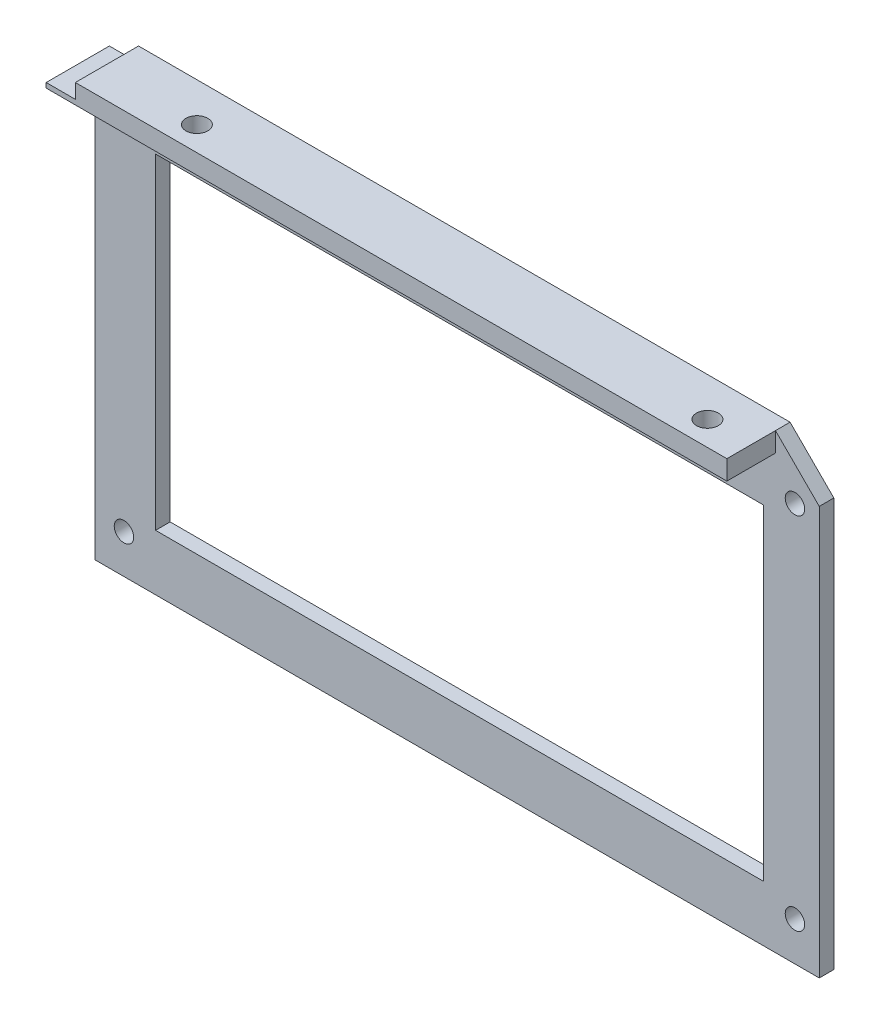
ISO-10303-21;
HEADER;
FILE_DESCRIPTION(('STEP AP214'),'2;1');
FILE_NAME('part.step','',(''),(''),'','','');
FILE_SCHEMA(('AUTOMOTIVE_DESIGN { 1 0 10303 214 1 1 1 1 }'));
ENDSEC;
DATA;
#1=APPLICATION_CONTEXT('core data for automotive mechanical design processes');
#2=APPLICATION_PROTOCOL_DEFINITION('international standard','automotive_design',2000,#1);
#3=PRODUCT_CONTEXT('',#1,'mechanical');
#4=PRODUCT('Part','Part','',(#3));
#5=PRODUCT_RELATED_PRODUCT_CATEGORY('part','',(#4));
#6=PRODUCT_DEFINITION_FORMATION('','',#4);
#7=PRODUCT_DEFINITION_CONTEXT('part definition',#1,'design');
#8=PRODUCT_DEFINITION('design','',#6,#7);
#9=PRODUCT_DEFINITION_SHAPE('','',#8);
#10=(LENGTH_UNIT() NAMED_UNIT(*) SI_UNIT(.MILLI.,.METRE.));
#11=(NAMED_UNIT(*) PLANE_ANGLE_UNIT() SI_UNIT($,.RADIAN.));
#12=(NAMED_UNIT(*) SI_UNIT($,.STERADIAN.) SOLID_ANGLE_UNIT());
#13=UNCERTAINTY_MEASURE_WITH_UNIT(LENGTH_MEASURE(1.E-05),#10,'distance_accuracy_value','');
#14=(GEOMETRIC_REPRESENTATION_CONTEXT(3) GLOBAL_UNCERTAINTY_ASSIGNED_CONTEXT((#13)) GLOBAL_UNIT_ASSIGNED_CONTEXT((#10,
#11,#12)) REPRESENTATION_CONTEXT('',''));
#15=CARTESIAN_POINT('',(0.,0.,0.));
#16=DIRECTION('',(0.,0.,1.));
#17=DIRECTION('',(1.,0.,0.));
#18=AXIS2_PLACEMENT_3D('',#15,#16,#17);
#19=CARTESIAN_POINT('',(-36.5,-8.,-3.5));
#20=DIRECTION('',(0.,0.707106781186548,-0.707106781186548));
#21=DIRECTION('',(0.,0.707106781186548,0.707106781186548));
#22=AXIS2_PLACEMENT_3D('',#19,#20,#21);
#23=PLANE('',#22);
#24=CARTESIAN_POINT('',(-36.5,-8.,-3.5));
#25=DIRECTION('',(0.,0.707106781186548,-0.707106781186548));
#26=DIRECTION('',(0.,-0.707106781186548,-0.707106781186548));
#27=AXIS2_PLACEMENT_3D('',#24,#25,#26);
#28=ELLIPSE('',#27,5.65685424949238,4.);
#29=CARTESIAN_POINT('',(-32.5,-8.,-3.5));
#30=VERTEX_POINT('',#29);
#31=CARTESIAN_POINT('',(-36.5,-4.,0.5));
#32=VERTEX_POINT('',#31);
#33=EDGE_CURVE('E397',#30,#32,#28,.F.);
#34=ORIENTED_EDGE('',*,*,#33,.F.);
#35=DIRECTION('',(1.,0.,0.));
#36=VECTOR('',#35,1.);
#37=CARTESIAN_POINT('',(-36.5,-8.,-3.5));
#38=LINE('',#37,#36);
#39=CARTESIAN_POINT('',(39.5,-8.,-3.5));
#40=VERTEX_POINT('',#39);
#41=EDGE_CURVE('E203',#30,#40,#38,.T.);
#42=ORIENTED_EDGE('',*,*,#41,.T.);
#43=CARTESIAN_POINT('',(43.5,-8.,-3.5));
#44=DIRECTION('',(0.,0.707106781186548,-0.707106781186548));
#45=DIRECTION('',(0.,-0.707106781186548,-0.707106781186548));
#46=AXIS2_PLACEMENT_3D('',#43,#44,#45);
#47=ELLIPSE('',#46,5.65685424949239,4.00000000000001);
#48=CARTESIAN_POINT('',(43.5,-3.99999999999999,0.5));
#49=VERTEX_POINT('',#48);
#50=EDGE_CURVE('E166',#49,#40,#47,.F.);
#51=ORIENTED_EDGE('',*,*,#50,.F.);
#52=DIRECTION('',(1.,0.,0.));
#53=VECTOR('',#52,1.);
#54=CARTESIAN_POINT('',(-36.5,-4.,0.5));
#55=LINE('',#54,#53);
#56=EDGE_CURVE('E188',#32,#49,#55,.T.);
#57=ORIENTED_EDGE('',*,*,#56,.F.);
#58=EDGE_LOOP('',(#34,#42,#51,#57));
#59=FACE_BOUND('',#58,.T.);
#60=ADVANCED_FACE('F41',(#59),#23,.F.);
#61=CARTESIAN_POINT('',(70.,-4.,-6.5));
#62=DIRECTION('',(1.,0.,0.));
#63=DIRECTION('',(0.,0.,-1.));
#64=AXIS2_PLACEMENT_3D('',#61,#62,#63);
#65=PLANE('',#64);
#66=DIRECTION('',(0.,0.,-1.));
#67=VECTOR('',#66,1.);
#68=CARTESIAN_POINT('',(70.,-4.,-6.5));
#69=LINE('',#68,#67);
#70=CARTESIAN_POINT('',(70.,-4.,6.5));
#71=VERTEX_POINT('',#70);
#72=CARTESIAN_POINT('',(70.,-4.,-3.5));
#73=VERTEX_POINT('',#72);
#74=EDGE_CURVE('E340',#71,#73,#69,.T.);
#75=ORIENTED_EDGE('',*,*,#74,.T.);
#76=DIRECTION('',(0.,-1.,0.));
#77=VECTOR('',#76,1.);
#78=CARTESIAN_POINT('',(70.,0.,-3.5));
#79=LINE('',#78,#77);
#80=CARTESIAN_POINT('',(70.,0.,-3.5));
#81=VERTEX_POINT('',#80);
#82=EDGE_CURVE('E176',#81,#73,#79,.T.);
#83=ORIENTED_EDGE('',*,*,#82,.F.);
#84=DIRECTION('',(0.,0.,-1.));
#85=VECTOR('',#84,1.);
#86=CARTESIAN_POINT('',(70.,0.,-6.5));
#87=LINE('',#86,#85);
#88=CARTESIAN_POINT('',(70.,0.,6.5));
#89=VERTEX_POINT('',#88);
#90=EDGE_CURVE('E336',#89,#81,#87,.T.);
#91=ORIENTED_EDGE('',*,*,#90,.F.);
#92=DIRECTION('',(0.,1.,0.));
#93=VECTOR('',#92,1.);
#94=CARTESIAN_POINT('',(70.,-4.,6.5));
#95=LINE('',#94,#93);
#96=EDGE_CURVE('E11',#71,#89,#95,.T.);
#97=ORIENTED_EDGE('',*,*,#96,.F.);
#98=EDGE_LOOP('',(#75,#83,#91,#97));
#99=FACE_BOUND('',#98,.T.);
#100=ADVANCED_FACE('F43',(#99),#65,.T.);
#101=CARTESIAN_POINT('',(0.,-4.,0.));
#102=DIRECTION('',(0.,1.,0.));
#103=DIRECTION('',(0.,0.,1.));
#104=AXIS2_PLACEMENT_3D('',#101,#102,#103);
#105=PLANE('',#104);
#106=CARTESIAN_POINT('',(61.,-4.,1.5));
#107=DIRECTION('',(0.,1.,0.));
#108=DIRECTION('',(0.,0.,1.));
#109=AXIS2_PLACEMENT_3D('',#106,#107,#108);
#110=CIRCLE('',#109,2.24999999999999);
#111=CARTESIAN_POINT('',(61.,-4.,3.74999999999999));
#112=VERTEX_POINT('',#111);
#113=EDGE_CURVE('E332',#112,#112,#110,.T.);
#114=ORIENTED_EDGE('',*,*,#113,.T.);
#115=EDGE_LOOP('',(#114));
#116=FACE_BOUND('',#115,.T.);
#117=CARTESIAN_POINT('',(-44.,-4.,1.50000000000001));
#118=DIRECTION('',(0.,1.,0.));
#119=DIRECTION('',(0.,0.,1.));
#120=AXIS2_PLACEMENT_3D('',#117,#118,#119);
#121=CIRCLE('',#120,2.25);
#122=CARTESIAN_POINT('',(-44.,-4.,3.75000000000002));
#123=VERTEX_POINT('',#122);
#124=EDGE_CURVE('E324',#123,#123,#121,.T.);
#125=ORIENTED_EDGE('',*,*,#124,.T.);
#126=EDGE_LOOP('',(#125));
#127=FACE_BOUND('',#126,.T.);
#128=DIRECTION('',(-1.,0.,0.));
#129=VECTOR('',#128,1.);
#130=CARTESIAN_POINT('',(0.,-4.,-3.5));
#131=LINE('',#130,#129);
#132=CARTESIAN_POINT('',(-36.5,-4.,-3.5));
#133=VERTEX_POINT('',#132);
#134=CARTESIAN_POINT('',(-70.,-4.,-3.5));
#135=VERTEX_POINT('',#134);
#136=EDGE_CURVE('E181',#133,#135,#131,.T.);
#137=ORIENTED_EDGE('',*,*,#136,.F.);
#138=DIRECTION('',(0.,0.,-1.));
#139=VECTOR('',#138,1.);
#140=CARTESIAN_POINT('',(-36.5,-4.,0.5));
#141=LINE('',#140,#139);
#142=EDGE_CURVE('E190',#32,#133,#141,.T.);
#143=ORIENTED_EDGE('',*,*,#142,.F.);
#144=ORIENTED_EDGE('',*,*,#56,.T.);
#145=DIRECTION('',(0.,0.,-1.));
#146=VECTOR('',#145,1.);
#147=CARTESIAN_POINT('',(43.5,-4.,0.5));
#148=LINE('',#147,#146);
#149=CARTESIAN_POINT('',(43.5,-3.99999999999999,-3.5));
#150=VERTEX_POINT('',#149);
#151=EDGE_CURVE('E164',#49,#150,#148,.T.);
#152=ORIENTED_EDGE('',*,*,#151,.T.);
#153=EDGE_CURVE('E171',#73,#150,#131,.T.);
#154=ORIENTED_EDGE('',*,*,#153,.F.);
#155=ORIENTED_EDGE('',*,*,#74,.F.);
#156=DIRECTION('',(1.,0.,0.));
#157=VECTOR('',#156,1.);
#158=CARTESIAN_POINT('',(-70.,-4.,6.5));
#159=LINE('',#158,#157);
#160=CARTESIAN_POINT('',(-70.,-4.,6.5));
#161=VERTEX_POINT('',#160);
#162=EDGE_CURVE('E347',#161,#71,#159,.T.);
#163=ORIENTED_EDGE('',*,*,#162,.F.);
#164=DIRECTION('',(0.,0.,1.));
#165=VECTOR('',#164,1.);
#166=CARTESIAN_POINT('',(-70.,-4.,-6.5));
#167=LINE('',#166,#165);
#168=EDGE_CURVE('E343',#135,#161,#167,.T.);
#169=ORIENTED_EDGE('',*,*,#168,.F.);
#170=EDGE_LOOP('',(#137,#143,#144,#152,#154,#155,#163,#169));
#171=FACE_BOUND('',#170,.T.);
#172=ADVANCED_FACE('F185',(#116,#127,#171),#105,.F.);
#173=CARTESIAN_POINT('',(-70.,-4.,6.5));
#174=DIRECTION('',(0.,0.,1.));
#175=DIRECTION('',(1.,0.,0.));
#176=AXIS2_PLACEMENT_3D('',#173,#174,#175);
#177=PLANE('',#176);
#178=DIRECTION('',(-1.,0.,0.));
#179=VECTOR('',#178,1.);
#180=CARTESIAN_POINT('',(-70.,-3.,6.5));
#181=LINE('',#180,#179);
#182=CARTESIAN_POINT('',(-64.,-3.,6.5));
#183=VERTEX_POINT('',#182);
#184=CARTESIAN_POINT('',(-70.,-3.,6.5));
#185=VERTEX_POINT('',#184);
#186=EDGE_CURVE('E388',#183,#185,#181,.T.);
#187=ORIENTED_EDGE('',*,*,#186,.T.);
#188=DIRECTION('',(0.,1.,0.));
#189=VECTOR('',#188,1.);
#190=CARTESIAN_POINT('',(-70.,-4.,6.5));
#191=LINE('',#190,#189);
#192=EDGE_CURVE('E51',#161,#185,#191,.T.);
#193=ORIENTED_EDGE('',*,*,#192,.F.);
#194=ORIENTED_EDGE('',*,*,#162,.T.);
#195=ORIENTED_EDGE('',*,*,#96,.T.);
#196=DIRECTION('',(1.,0.,0.));
#197=VECTOR('',#196,1.);
#198=CARTESIAN_POINT('',(-70.,0.,6.5));
#199=LINE('',#198,#197);
#200=CARTESIAN_POINT('',(-64.,0.,6.5));
#201=VERTEX_POINT('',#200);
#202=EDGE_CURVE('E344',#201,#89,#199,.T.);
#203=ORIENTED_EDGE('',*,*,#202,.F.);
#204=DIRECTION('',(0.,-1.,0.));
#205=VECTOR('',#204,1.);
#206=CARTESIAN_POINT('',(-64.,0.,6.5));
#207=LINE('',#206,#205);
#208=EDGE_CURVE('E59',#201,#183,#207,.T.);
#209=ORIENTED_EDGE('',*,*,#208,.T.);
#210=EDGE_LOOP('',(#187,#193,#194,#195,#203,#209));
#211=FACE_BOUND('',#210,.T.);
#212=ADVANCED_FACE('F385',(#211),#177,.T.);
#213=CARTESIAN_POINT('',(-70.,-4.,-6.5));
#214=DIRECTION('',(-1.,0.,0.));
#215=DIRECTION('',(0.,0.,1.));
#216=AXIS2_PLACEMENT_3D('',#213,#214,#215);
#217=PLANE('',#216);
#218=DIRECTION('',(0.,0.,-1.));
#219=VECTOR('',#218,1.);
#220=CARTESIAN_POINT('',(-70.,-3.,6.501));
#221=LINE('',#220,#219);
#222=CARTESIAN_POINT('',(-70.,-3.,-6.5));
#223=VERTEX_POINT('',#222);
#224=EDGE_CURVE('E191',#185,#223,#221,.T.);
#225=ORIENTED_EDGE('',*,*,#224,.T.);
#226=DIRECTION('',(0.,1.,0.));
#227=VECTOR('',#226,1.);
#228=CARTESIAN_POINT('',(-70.,-4.,-6.5));
#229=LINE('',#228,#227);
#230=CARTESIAN_POINT('',(-70.,-93.,-6.5));
#231=VERTEX_POINT('',#230);
#232=EDGE_CURVE('E45',#231,#223,#229,.T.);
#233=ORIENTED_EDGE('',*,*,#232,.F.);
#234=DIRECTION('',(0.,0.,-1.));
#235=VECTOR('',#234,1.);
#236=CARTESIAN_POINT('',(-70.,-93.,-3.5));
#237=LINE('',#236,#235);
#238=CARTESIAN_POINT('',(-70.,-93.,-3.5));
#239=VERTEX_POINT('',#238);
#240=EDGE_CURVE('E310',#239,#231,#237,.T.);
#241=ORIENTED_EDGE('',*,*,#240,.F.);
#242=DIRECTION('',(0.,-1.,0.));
#243=VECTOR('',#242,1.);
#244=CARTESIAN_POINT('',(-70.,0.,-3.5));
#245=LINE('',#244,#243);
#246=EDGE_CURVE('E282',#135,#239,#245,.T.);
#247=ORIENTED_EDGE('',*,*,#246,.F.);
#248=ORIENTED_EDGE('',*,*,#168,.T.);
#249=ORIENTED_EDGE('',*,*,#192,.T.);
#250=EDGE_LOOP('',(#225,#233,#241,#247,#248,#249));
#251=FACE_BOUND('',#250,.T.);
#252=ADVANCED_FACE('F374',(#251),#217,.T.);
#253=CARTESIAN_POINT('',(-70.,-4.,-6.5));
#254=DIRECTION('',(0.,0.,-1.));
#255=DIRECTION('',(-1.,0.,0.));
#256=AXIS2_PLACEMENT_3D('',#253,#254,#255);
#257=PLANE('',#256);
#258=DIRECTION('',(-1.,0.,0.));
#259=VECTOR('',#258,1.);
#260=CARTESIAN_POINT('',(-70.,-3.,-6.5));
#261=LINE('',#260,#259);
#262=CARTESIAN_POINT('',(-64.,-3.,-6.5));
#263=VERTEX_POINT('',#262);
#264=EDGE_CURVE('E370',#263,#223,#261,.T.);
#265=ORIENTED_EDGE('',*,*,#264,.F.);
#266=DIRECTION('',(0.,-1.,0.));
#267=VECTOR('',#266,1.);
#268=CARTESIAN_POINT('',(-64.,0.,-6.5));
#269=LINE('',#268,#267);
#270=CARTESIAN_POINT('',(-64.,0.,-6.5));
#271=VERTEX_POINT('',#270);
#272=EDGE_CURVE('E391',#271,#263,#269,.T.);
#273=ORIENTED_EDGE('',*,*,#272,.F.);
#274=DIRECTION('',(-1.,0.,0.));
#275=VECTOR('',#274,1.);
#276=CARTESIAN_POINT('',(-70.,0.,-6.5));
#277=LINE('',#276,#275);
#278=CARTESIAN_POINT('',(70.,0.,-6.5));
#279=VERTEX_POINT('',#278);
#280=EDGE_CURVE('E354',#279,#271,#277,.T.);
#281=ORIENTED_EDGE('',*,*,#280,.F.);
#282=DIRECTION('',(0.707106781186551,-0.707106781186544,0.));
#283=VECTOR('',#282,1.);
#284=CARTESIAN_POINT('',(34.9999999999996,35.,-6.5));
#285=LINE('',#284,#283);
#286=CARTESIAN_POINT('',(79.,-8.9999999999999,-6.5));
#287=VERTEX_POINT('',#286);
#288=EDGE_CURVE('E272',#279,#287,#285,.T.);
#289=ORIENTED_EDGE('',*,*,#288,.T.);
#290=DIRECTION('',(0.,1.,0.));
#291=VECTOR('',#290,1.);
#292=CARTESIAN_POINT('',(79.,0.,-6.5));
#293=LINE('',#292,#291);
#294=CARTESIAN_POINT('',(79.,-93.,-6.5));
#295=VERTEX_POINT('',#294);
#296=EDGE_CURVE('E303',#295,#287,#293,.T.);
#297=ORIENTED_EDGE('',*,*,#296,.F.);
#298=DIRECTION('',(-1.,0.,0.));
#299=VECTOR('',#298,1.);
#300=CARTESIAN_POINT('',(0.,-93.,-6.5));
#301=LINE('',#300,#299);
#302=EDGE_CURVE('E284',#295,#231,#301,.T.);
#303=ORIENTED_EDGE('',*,*,#302,.T.);
#304=ORIENTED_EDGE('',*,*,#232,.T.);
#305=EDGE_LOOP('',(#265,#273,#281,#289,#297,#303,#304));
#306=FACE_BOUND('',#305,.T.);
#307=CARTESIAN_POINT('',(-64.,-85.,-6.5));
#308=DIRECTION('',(0.,0.,-1.));
#309=DIRECTION('',(-1.,0.,0.));
#310=AXIS2_PLACEMENT_3D('',#307,#308,#309);
#311=CIRCLE('',#310,1.99999999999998);
#312=CARTESIAN_POINT('',(-66.,-85.,-6.5));
#313=VERTEX_POINT('',#312);
#314=EDGE_CURVE('E232',#313,#313,#311,.T.);
#315=ORIENTED_EDGE('',*,*,#314,.F.);
#316=EDGE_LOOP('',(#315));
#317=FACE_BOUND('',#316,.T.);
#318=CARTESIAN_POINT('',(74.,-85.,-6.5));
#319=DIRECTION('',(0.,0.,-1.));
#320=DIRECTION('',(-1.,0.,0.));
#321=AXIS2_PLACEMENT_3D('',#318,#319,#320);
#322=CIRCLE('',#321,2.);
#323=CARTESIAN_POINT('',(72.,-85.,-6.5));
#324=VERTEX_POINT('',#323);
#325=EDGE_CURVE('E224',#324,#324,#322,.T.);
#326=ORIENTED_EDGE('',*,*,#325,.F.);
#327=EDGE_LOOP('',(#326));
#328=FACE_BOUND('',#327,.T.);
#329=CARTESIAN_POINT('',(74.,-11.,-6.5));
#330=DIRECTION('',(0.,0.,-1.));
#331=DIRECTION('',(-1.,0.,0.));
#332=AXIS2_PLACEMENT_3D('',#329,#330,#331);
#333=CIRCLE('',#332,2.);
#334=CARTESIAN_POINT('',(72.,-11.,-6.5));
#335=VERTEX_POINT('',#334);
#336=EDGE_CURVE('E216',#335,#335,#333,.T.);
#337=ORIENTED_EDGE('',*,*,#336,.F.);
#338=EDGE_LOOP('',(#337));
#339=FACE_BOUND('',#338,.T.);
#340=CARTESIAN_POINT('',(-64.,-11.,-6.5));
#341=DIRECTION('',(0.,0.,-1.));
#342=DIRECTION('',(-1.,0.,0.));
#343=AXIS2_PLACEMENT_3D('',#340,#341,#342);
#344=CIRCLE('',#343,2.);
#345=CARTESIAN_POINT('',(-66.,-11.,-6.5));
#346=VERTEX_POINT('',#345);
#347=EDGE_CURVE('E207',#346,#346,#344,.T.);
#348=ORIENTED_EDGE('',*,*,#347,.F.);
#349=EDGE_LOOP('',(#348));
#350=FACE_BOUND('',#349,.T.);
#351=DIRECTION('',(1.,0.,0.));
#352=VECTOR('',#351,1.);
#353=CARTESIAN_POINT('',(0.,-14.4855072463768,-6.5));
#354=LINE('',#353,#352);
#355=CARTESIAN_POINT('',(-57.5,-14.4855072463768,-6.5));
#356=VERTEX_POINT('',#355);
#357=CARTESIAN_POINT('',(67.5,-14.4855072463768,-6.5));
#358=VERTEX_POINT('',#357);
#359=EDGE_CURVE('E211',#356,#358,#354,.T.);
#360=ORIENTED_EDGE('',*,*,#359,.F.);
#361=DIRECTION('',(0.,-1.,0.));
#362=VECTOR('',#361,1.);
#363=CARTESIAN_POINT('',(-57.5,0.,-6.5));
#364=LINE('',#363,#362);
#365=CARTESIAN_POINT('',(-57.5,-81.5144927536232,-6.5));
#366=VERTEX_POINT('',#365);
#367=EDGE_CURVE('E244',#356,#366,#364,.T.);
#368=ORIENTED_EDGE('',*,*,#367,.T.);
#369=DIRECTION('',(1.,0.,0.));
#370=VECTOR('',#369,1.);
#371=CARTESIAN_POINT('',(0.,-81.5144927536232,-6.5));
#372=LINE('',#371,#370);
#373=CARTESIAN_POINT('',(67.5,-81.5144927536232,-6.5));
#374=VERTEX_POINT('',#373);
#375=EDGE_CURVE('E262',#366,#374,#372,.T.);
#376=ORIENTED_EDGE('',*,*,#375,.T.);
#377=DIRECTION('',(0.,-1.,0.));
#378=VECTOR('',#377,1.);
#379=CARTESIAN_POINT('',(67.5,0.,-6.5));
#380=LINE('',#379,#378);
#381=EDGE_CURVE('E258',#358,#374,#380,.T.);
#382=ORIENTED_EDGE('',*,*,#381,.F.);
#383=EDGE_LOOP('',(#360,#368,#376,#382));
#384=FACE_BOUND('',#383,.T.);
#385=ADVANCED_FACE('F367',(#306,#317,#328,#339,#350,#384),#257,.T.);
#386=CARTESIAN_POINT('',(0.,0.,0.));
#387=DIRECTION('',(0.,1.,0.));
#388=DIRECTION('',(0.,0.,1.));
#389=AXIS2_PLACEMENT_3D('',#386,#387,#388);
#390=PLANE('',#389);
#391=DIRECTION('',(0.,0.,-1.));
#392=VECTOR('',#391,1.);
#393=CARTESIAN_POINT('',(-64.,0.,6.501));
#394=LINE('',#393,#392);
#395=EDGE_CURVE('E402',#201,#271,#394,.T.);
#396=ORIENTED_EDGE('',*,*,#395,.F.);
#397=ORIENTED_EDGE('',*,*,#202,.T.);
#398=ORIENTED_EDGE('',*,*,#90,.T.);
#399=DIRECTION('',(0.,0.,-1.));
#400=VECTOR('',#399,1.);
#401=CARTESIAN_POINT('',(70.,0.,-3.5));
#402=LINE('',#401,#400);
#403=EDGE_CURVE('E299',#81,#279,#402,.T.);
#404=ORIENTED_EDGE('',*,*,#403,.T.);
#405=ORIENTED_EDGE('',*,*,#280,.T.);
#406=EDGE_LOOP('',(#396,#397,#398,#404,#405));
#407=FACE_BOUND('',#406,.T.);
#408=CARTESIAN_POINT('',(-44.,0.,1.50000000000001));
#409=DIRECTION('',(0.,1.,0.));
#410=DIRECTION('',(0.,0.,1.));
#411=AXIS2_PLACEMENT_3D('',#408,#409,#410);
#412=CIRCLE('',#411,2.25);
#413=CARTESIAN_POINT('',(-44.,0.,3.75000000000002));
#414=VERTEX_POINT('',#413);
#415=EDGE_CURVE('E314',#414,#414,#412,.T.);
#416=ORIENTED_EDGE('',*,*,#415,.F.);
#417=EDGE_LOOP('',(#416));
#418=FACE_BOUND('',#417,.T.);
#419=CARTESIAN_POINT('',(61.,0.,1.5));
#420=DIRECTION('',(0.,1.,0.));
#421=DIRECTION('',(0.,0.,1.));
#422=AXIS2_PLACEMENT_3D('',#419,#420,#421);
#423=CIRCLE('',#422,2.24999999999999);
#424=CARTESIAN_POINT('',(61.,0.,3.74999999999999));
#425=VERTEX_POINT('',#424);
#426=EDGE_CURVE('E328',#425,#425,#423,.T.);
#427=ORIENTED_EDGE('',*,*,#426,.F.);
#428=EDGE_LOOP('',(#427));
#429=FACE_BOUND('',#428,.T.);
#430=ADVANCED_FACE('F409',(#407,#418,#429),#390,.T.);
#431=CARTESIAN_POINT('',(61.,-4.,1.5));
#432=DIRECTION('',(0.,1.,0.));
#433=DIRECTION('',(0.,0.,1.));
#434=AXIS2_PLACEMENT_3D('',#431,#432,#433);
#435=CYLINDRICAL_SURFACE('',#434,2.24999999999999);
#436=ORIENTED_EDGE('',*,*,#113,.F.);
#437=EDGE_LOOP('',(#436));
#438=FACE_BOUND('',#437,.T.);
#439=ORIENTED_EDGE('',*,*,#426,.T.);
#440=EDGE_LOOP('',(#439));
#441=FACE_BOUND('',#440,.T.);
#442=ADVANCED_FACE('F475',(#438,#441),#435,.F.);
#443=CARTESIAN_POINT('',(-44.,-4.,1.50000000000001));
#444=DIRECTION('',(0.,1.,0.));
#445=DIRECTION('',(0.,0.,1.));
#446=AXIS2_PLACEMENT_3D('',#443,#444,#445);
#447=CYLINDRICAL_SURFACE('',#446,2.25);
#448=ORIENTED_EDGE('',*,*,#124,.F.);
#449=EDGE_LOOP('',(#448));
#450=FACE_BOUND('',#449,.T.);
#451=ORIENTED_EDGE('',*,*,#415,.T.);
#452=EDGE_LOOP('',(#451));
#453=FACE_BOUND('',#452,.T.);
#454=ADVANCED_FACE('F467',(#450,#453),#447,.F.);
#455=CARTESIAN_POINT('',(0.,-93.,-3.5));
#456=DIRECTION('',(0.,-1.,0.));
#457=DIRECTION('',(0.,0.,-1.));
#458=AXIS2_PLACEMENT_3D('',#455,#456,#457);
#459=PLANE('',#458);
#460=ORIENTED_EDGE('',*,*,#302,.F.);
#461=DIRECTION('',(0.,0.,-1.));
#462=VECTOR('',#461,1.);
#463=CARTESIAN_POINT('',(79.,-93.,-3.5));
#464=LINE('',#463,#462);
#465=CARTESIAN_POINT('',(79.,-93.,-3.5));
#466=VERTEX_POINT('',#465);
#467=EDGE_CURVE('E315',#466,#295,#464,.T.);
#468=ORIENTED_EDGE('',*,*,#467,.F.);
#469=DIRECTION('',(-1.,0.,0.));
#470=VECTOR('',#469,1.);
#471=CARTESIAN_POINT('',(0.,-93.,-3.5));
#472=LINE('',#471,#470);
#473=EDGE_CURVE('E295',#466,#239,#472,.T.);
#474=ORIENTED_EDGE('',*,*,#473,.T.);
#475=ORIENTED_EDGE('',*,*,#240,.T.);
#476=EDGE_LOOP('',(#460,#468,#474,#475));
#477=FACE_BOUND('',#476,.T.);
#478=ADVANCED_FACE('F377',(#477),#459,.T.);
#479=CARTESIAN_POINT('',(79.,0.,-3.5));
#480=DIRECTION('',(-1.,0.,0.));
#481=DIRECTION('',(0.,0.,1.));
#482=AXIS2_PLACEMENT_3D('',#479,#480,#481);
#483=PLANE('',#482);
#484=ORIENTED_EDGE('',*,*,#296,.T.);
#485=DIRECTION('',(0.,0.,-1.));
#486=VECTOR('',#485,1.);
#487=CARTESIAN_POINT('',(79.,-8.9999999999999,-3.5));
#488=LINE('',#487,#486);
#489=CARTESIAN_POINT('',(79.,-8.9999999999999,-3.5));
#490=VERTEX_POINT('',#489);
#491=EDGE_CURVE('E318',#490,#287,#488,.T.);
#492=ORIENTED_EDGE('',*,*,#491,.F.);
#493=DIRECTION('',(0.,1.,0.));
#494=VECTOR('',#493,1.);
#495=CARTESIAN_POINT('',(79.,0.,-3.5));
#496=LINE('',#495,#494);
#497=EDGE_CURVE('E292',#466,#490,#496,.T.);
#498=ORIENTED_EDGE('',*,*,#497,.F.);
#499=ORIENTED_EDGE('',*,*,#467,.T.);
#500=EDGE_LOOP('',(#484,#492,#498,#499));
#501=FACE_BOUND('',#500,.T.);
#502=ADVANCED_FACE('F466',(#501),#483,.F.);
#503=CARTESIAN_POINT('',(34.9999999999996,35.,-3.5));
#504=DIRECTION('',(0.707106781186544,0.707106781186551,0.));
#505=DIRECTION('',(-0.707106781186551,0.707106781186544,0.));
#506=AXIS2_PLACEMENT_3D('',#503,#504,#505);
#507=PLANE('',#506);
#508=ORIENTED_EDGE('',*,*,#288,.F.);
#509=ORIENTED_EDGE('',*,*,#403,.F.);
#510=DIRECTION('',(0.707106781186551,-0.707106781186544,0.));
#511=VECTOR('',#510,1.);
#512=CARTESIAN_POINT('',(34.9999999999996,35.,-3.5));
#513=LINE('',#512,#511);
#514=EDGE_CURVE('E288',#81,#490,#513,.T.);
#515=ORIENTED_EDGE('',*,*,#514,.T.);
#516=ORIENTED_EDGE('',*,*,#491,.T.);
#517=EDGE_LOOP('',(#508,#509,#515,#516));
#518=FACE_BOUND('',#517,.T.);
#519=ADVANCED_FACE('F412',(#518),#507,.T.);
#520=CARTESIAN_POINT('',(0.,0.,-3.5));
#521=DIRECTION('',(0.,0.,-1.));
#522=DIRECTION('',(-1.,0.,0.));
#523=AXIS2_PLACEMENT_3D('',#520,#521,#522);
#524=PLANE('',#523);
#525=ORIENTED_EDGE('',*,*,#41,.F.);
#526=CARTESIAN_POINT('',(-36.5,-8.,-3.5));
#527=DIRECTION('',(0.,0.,1.));
#528=DIRECTION('',(1.,0.,0.));
#529=AXIS2_PLACEMENT_3D('',#526,#527,#528);
#530=CIRCLE('',#529,4.);
#531=EDGE_CURVE('E67',#30,#133,#530,.T.);
#532=ORIENTED_EDGE('',*,*,#531,.T.);
#533=ORIENTED_EDGE('',*,*,#136,.T.);
#534=ORIENTED_EDGE('',*,*,#246,.T.);
#535=ORIENTED_EDGE('',*,*,#473,.F.);
#536=ORIENTED_EDGE('',*,*,#497,.T.);
#537=ORIENTED_EDGE('',*,*,#514,.F.);
#538=ORIENTED_EDGE('',*,*,#82,.T.);
#539=ORIENTED_EDGE('',*,*,#153,.T.);
#540=CARTESIAN_POINT('',(43.5,-8.,-3.5));
#541=DIRECTION('',(0.,0.,1.));
#542=DIRECTION('',(1.,0.,0.));
#543=AXIS2_PLACEMENT_3D('',#540,#541,#542);
#544=CIRCLE('',#543,4.00000000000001);
#545=EDGE_CURVE('E160',#150,#40,#544,.T.);
#546=ORIENTED_EDGE('',*,*,#545,.T.);
#547=EDGE_LOOP('',(#525,#532,#533,#534,#535,#536,#537,#538,#539,#546));
#548=FACE_BOUND('',#547,.T.);
#549=CARTESIAN_POINT('',(-64.,-85.,-3.5));
#550=DIRECTION('',(0.,0.,-1.));
#551=DIRECTION('',(-1.,0.,0.));
#552=AXIS2_PLACEMENT_3D('',#549,#550,#551);
#553=CIRCLE('',#552,1.99999999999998);
#554=CARTESIAN_POINT('',(-66.,-85.,-3.5));
#555=VERTEX_POINT('',#554);
#556=EDGE_CURVE('E206',#555,#555,#553,.T.);
#557=ORIENTED_EDGE('',*,*,#556,.T.);
#558=EDGE_LOOP('',(#557));
#559=FACE_BOUND('',#558,.T.);
#560=CARTESIAN_POINT('',(74.,-85.,-3.5));
#561=DIRECTION('',(0.,0.,-1.));
#562=DIRECTION('',(-1.,0.,0.));
#563=AXIS2_PLACEMENT_3D('',#560,#561,#562);
#564=CIRCLE('',#563,2.);
#565=CARTESIAN_POINT('',(72.,-85.,-3.5));
#566=VERTEX_POINT('',#565);
#567=EDGE_CURVE('E228',#566,#566,#564,.T.);
#568=ORIENTED_EDGE('',*,*,#567,.T.);
#569=EDGE_LOOP('',(#568));
#570=FACE_BOUND('',#569,.T.);
#571=CARTESIAN_POINT('',(74.,-11.,-3.5));
#572=DIRECTION('',(0.,0.,-1.));
#573=DIRECTION('',(-1.,0.,0.));
#574=AXIS2_PLACEMENT_3D('',#571,#572,#573);
#575=CIRCLE('',#574,2.);
#576=CARTESIAN_POINT('',(72.,-11.,-3.5));
#577=VERTEX_POINT('',#576);
#578=EDGE_CURVE('E220',#577,#577,#575,.T.);
#579=ORIENTED_EDGE('',*,*,#578,.T.);
#580=EDGE_LOOP('',(#579));
#581=FACE_BOUND('',#580,.T.);
#582=CARTESIAN_POINT('',(-64.,-11.,-3.5));
#583=DIRECTION('',(0.,0.,-1.));
#584=DIRECTION('',(-1.,0.,0.));
#585=AXIS2_PLACEMENT_3D('',#582,#583,#584);
#586=CIRCLE('',#585,2.);
#587=CARTESIAN_POINT('',(-66.,-11.,-3.5));
#588=VERTEX_POINT('',#587);
#589=EDGE_CURVE('E212',#588,#588,#586,.T.);
#590=ORIENTED_EDGE('',*,*,#589,.T.);
#591=EDGE_LOOP('',(#590));
#592=FACE_BOUND('',#591,.T.);
#593=DIRECTION('',(0.,-1.,0.));
#594=VECTOR('',#593,1.);
#595=CARTESIAN_POINT('',(-57.5,0.,-3.5));
#596=LINE('',#595,#594);
#597=CARTESIAN_POINT('',(-57.5,-14.4855072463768,-3.5));
#598=VERTEX_POINT('',#597);
#599=CARTESIAN_POINT('',(-57.5,-81.5144927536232,-3.5));
#600=VERTEX_POINT('',#599);
#601=EDGE_CURVE('E252',#598,#600,#596,.T.);
#602=ORIENTED_EDGE('',*,*,#601,.F.);
#603=DIRECTION('',(1.,0.,0.));
#604=VECTOR('',#603,1.);
#605=CARTESIAN_POINT('',(0.,-14.4855072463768,-3.5));
#606=LINE('',#605,#604);
#607=CARTESIAN_POINT('',(67.5,-14.4855072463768,-3.5));
#608=VERTEX_POINT('',#607);
#609=EDGE_CURVE('E239',#598,#608,#606,.T.);
#610=ORIENTED_EDGE('',*,*,#609,.T.);
#611=DIRECTION('',(0.,-1.,0.));
#612=VECTOR('',#611,1.);
#613=CARTESIAN_POINT('',(67.5,0.,-3.5));
#614=LINE('',#613,#612);
#615=CARTESIAN_POINT('',(67.5,-81.5144927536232,-3.5));
#616=VERTEX_POINT('',#615);
#617=EDGE_CURVE('E243',#608,#616,#614,.T.);
#618=ORIENTED_EDGE('',*,*,#617,.T.);
#619=DIRECTION('',(1.,0.,0.));
#620=VECTOR('',#619,1.);
#621=CARTESIAN_POINT('',(0.,-81.5144927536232,-3.5));
#622=LINE('',#621,#620);
#623=EDGE_CURVE('E248',#600,#616,#622,.T.);
#624=ORIENTED_EDGE('',*,*,#623,.F.);
#625=EDGE_LOOP('',(#602,#610,#618,#624));
#626=FACE_BOUND('',#625,.T.);
#627=ADVANCED_FACE('F172',(#548,#559,#570,#581,#592,#626),#524,.F.);
#628=CARTESIAN_POINT('',(0.,-14.4855072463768,-3.5));
#629=DIRECTION('',(0.,1.,0.));
#630=DIRECTION('',(0.,0.,1.));
#631=AXIS2_PLACEMENT_3D('',#628,#629,#630);
#632=PLANE('',#631);
#633=ORIENTED_EDGE('',*,*,#359,.T.);
#634=DIRECTION('',(0.,0.,-1.));
#635=VECTOR('',#634,1.);
#636=CARTESIAN_POINT('',(67.5,-14.4855072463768,-3.5));
#637=LINE('',#636,#635);
#638=EDGE_CURVE('E255',#608,#358,#637,.T.);
#639=ORIENTED_EDGE('',*,*,#638,.F.);
#640=ORIENTED_EDGE('',*,*,#609,.F.);
#641=DIRECTION('',(0.,0.,-1.));
#642=VECTOR('',#641,1.);
#643=CARTESIAN_POINT('',(-57.5,-14.4855072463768,-3.5));
#644=LINE('',#643,#642);
#645=EDGE_CURVE('E269',#598,#356,#644,.T.);
#646=ORIENTED_EDGE('',*,*,#645,.T.);
#647=EDGE_LOOP('',(#633,#639,#640,#646));
#648=FACE_BOUND('',#647,.T.);
#649=ADVANCED_FACE('F451',(#648),#632,.F.);
#650=CARTESIAN_POINT('',(-57.5,0.,-3.5));
#651=DIRECTION('',(1.,0.,0.));
#652=DIRECTION('',(0.,0.,-1.));
#653=AXIS2_PLACEMENT_3D('',#650,#651,#652);
#654=PLANE('',#653);
#655=ORIENTED_EDGE('',*,*,#367,.F.);
#656=ORIENTED_EDGE('',*,*,#645,.F.);
#657=ORIENTED_EDGE('',*,*,#601,.T.);
#658=DIRECTION('',(0.,0.,-1.));
#659=VECTOR('',#658,1.);
#660=CARTESIAN_POINT('',(-57.5,-81.5144927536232,-3.5));
#661=LINE('',#660,#659);
#662=EDGE_CURVE('E273',#600,#366,#661,.T.);
#663=ORIENTED_EDGE('',*,*,#662,.T.);
#664=EDGE_LOOP('',(#655,#656,#657,#663));
#665=FACE_BOUND('',#664,.T.);
#666=ADVANCED_FACE('F447',(#665),#654,.T.);
#667=CARTESIAN_POINT('',(0.,-81.5144927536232,-3.5));
#668=DIRECTION('',(0.,1.,0.));
#669=DIRECTION('',(0.,0.,1.));
#670=AXIS2_PLACEMENT_3D('',#667,#668,#669);
#671=PLANE('',#670);
#672=ORIENTED_EDGE('',*,*,#375,.F.);
#673=ORIENTED_EDGE('',*,*,#662,.F.);
#674=ORIENTED_EDGE('',*,*,#623,.T.);
#675=DIRECTION('',(0.,0.,-1.));
#676=VECTOR('',#675,1.);
#677=CARTESIAN_POINT('',(67.5,-81.5144927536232,-3.5));
#678=LINE('',#677,#676);
#679=EDGE_CURVE('E276',#616,#374,#678,.T.);
#680=ORIENTED_EDGE('',*,*,#679,.T.);
#681=EDGE_LOOP('',(#672,#673,#674,#680));
#682=FACE_BOUND('',#681,.T.);
#683=ADVANCED_FACE('F450',(#682),#671,.T.);
#684=CARTESIAN_POINT('',(67.5,0.,-3.5));
#685=DIRECTION('',(1.,0.,0.));
#686=DIRECTION('',(0.,0.,-1.));
#687=AXIS2_PLACEMENT_3D('',#684,#685,#686);
#688=PLANE('',#687);
#689=ORIENTED_EDGE('',*,*,#381,.T.);
#690=ORIENTED_EDGE('',*,*,#679,.F.);
#691=ORIENTED_EDGE('',*,*,#617,.F.);
#692=ORIENTED_EDGE('',*,*,#638,.T.);
#693=EDGE_LOOP('',(#689,#690,#691,#692));
#694=FACE_BOUND('',#693,.T.);
#695=ADVANCED_FACE('F433',(#694),#688,.F.);
#696=CARTESIAN_POINT('',(-64.,-11.,-3.5));
#697=DIRECTION('',(0.,0.,-1.));
#698=DIRECTION('',(-1.,0.,0.));
#699=AXIS2_PLACEMENT_3D('',#696,#697,#698);
#700=CYLINDRICAL_SURFACE('',#699,2.);
#701=ORIENTED_EDGE('',*,*,#589,.F.);
#702=EDGE_LOOP('',(#701));
#703=FACE_BOUND('',#702,.T.);
#704=ORIENTED_EDGE('',*,*,#347,.T.);
#705=EDGE_LOOP('',(#704));
#706=FACE_BOUND('',#705,.T.);
#707=ADVANCED_FACE('F429',(#703,#706),#700,.F.);
#708=CARTESIAN_POINT('',(74.,-11.,-3.5));
#709=DIRECTION('',(0.,0.,-1.));
#710=DIRECTION('',(-1.,0.,0.));
#711=AXIS2_PLACEMENT_3D('',#708,#709,#710);
#712=CYLINDRICAL_SURFACE('',#711,2.);
#713=ORIENTED_EDGE('',*,*,#578,.F.);
#714=EDGE_LOOP('',(#713));
#715=FACE_BOUND('',#714,.T.);
#716=ORIENTED_EDGE('',*,*,#336,.T.);
#717=EDGE_LOOP('',(#716));
#718=FACE_BOUND('',#717,.T.);
#719=ADVANCED_FACE('F432',(#715,#718),#712,.F.);
#720=CARTESIAN_POINT('',(74.,-85.,-3.5));
#721=DIRECTION('',(0.,0.,-1.));
#722=DIRECTION('',(-1.,0.,0.));
#723=AXIS2_PLACEMENT_3D('',#720,#721,#722);
#724=CYLINDRICAL_SURFACE('',#723,2.);
#725=ORIENTED_EDGE('',*,*,#567,.F.);
#726=EDGE_LOOP('',(#725));
#727=FACE_BOUND('',#726,.T.);
#728=ORIENTED_EDGE('',*,*,#325,.T.);
#729=EDGE_LOOP('',(#728));
#730=FACE_BOUND('',#729,.T.);
#731=ADVANCED_FACE('F437',(#727,#730),#724,.F.);
#732=CARTESIAN_POINT('',(-64.,-85.,-3.5));
#733=DIRECTION('',(0.,0.,-1.));
#734=DIRECTION('',(-1.,0.,0.));
#735=AXIS2_PLACEMENT_3D('',#732,#733,#734);
#736=CYLINDRICAL_SURFACE('',#735,1.99999999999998);
#737=ORIENTED_EDGE('',*,*,#556,.F.);
#738=EDGE_LOOP('',(#737));
#739=FACE_BOUND('',#738,.T.);
#740=ORIENTED_EDGE('',*,*,#314,.T.);
#741=EDGE_LOOP('',(#740));
#742=FACE_BOUND('',#741,.T.);
#743=ADVANCED_FACE('F441',(#739,#742),#736,.F.);
#744=CARTESIAN_POINT('',(-70.,-3.,6.501));
#745=DIRECTION('',(0.,-1.,0.));
#746=DIRECTION('',(1.,0.,0.));
#747=AXIS2_PLACEMENT_3D('',#744,#745,#746);
#748=PLANE('',#747);
#749=DIRECTION('',(0.,0.,-1.));
#750=VECTOR('',#749,1.);
#751=CARTESIAN_POINT('',(-64.,-3.,6.501));
#752=LINE('',#751,#750);
#753=EDGE_CURVE('E197',#183,#263,#752,.T.);
#754=ORIENTED_EDGE('',*,*,#753,.T.);
#755=ORIENTED_EDGE('',*,*,#264,.T.);
#756=ORIENTED_EDGE('',*,*,#224,.F.);
#757=ORIENTED_EDGE('',*,*,#186,.F.);
#758=EDGE_LOOP('',(#754,#755,#756,#757));
#759=FACE_BOUND('',#758,.T.);
#760=ADVANCED_FACE('F445',(#759),#748,.F.);
#761=CARTESIAN_POINT('',(-64.,0.,6.501));
#762=DIRECTION('',(1.,0.,0.));
#763=DIRECTION('',(0.,0.,-1.));
#764=AXIS2_PLACEMENT_3D('',#761,#762,#763);
#765=PLANE('',#764);
#766=ORIENTED_EDGE('',*,*,#395,.T.);
#767=ORIENTED_EDGE('',*,*,#272,.T.);
#768=ORIENTED_EDGE('',*,*,#753,.F.);
#769=ORIENTED_EDGE('',*,*,#208,.F.);
#770=EDGE_LOOP('',(#766,#767,#768,#769));
#771=FACE_BOUND('',#770,.T.);
#772=ADVANCED_FACE('F406',(#771),#765,.F.);
#773=CARTESIAN_POINT('',(43.5,-8.,2.5));
#774=DIRECTION('',(0.,0.,-1.));
#775=DIRECTION('',(-1.,0.,0.));
#776=AXIS2_PLACEMENT_3D('',#773,#774,#775);
#777=CYLINDRICAL_SURFACE('',#776,4.00000000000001);
#778=ORIENTED_EDGE('',*,*,#50,.T.);
#779=ORIENTED_EDGE('',*,*,#545,.F.);
#780=ORIENTED_EDGE('',*,*,#151,.F.);
#781=EDGE_LOOP('',(#778,#779,#780));
#782=FACE_BOUND('',#781,.T.);
#783=ADVANCED_FACE('F162',(#782),#777,.F.);
#784=CARTESIAN_POINT('',(-36.5,-8.,2.5));
#785=DIRECTION('',(0.,0.,-1.));
#786=DIRECTION('',(-1.,0.,0.));
#787=AXIS2_PLACEMENT_3D('',#784,#785,#786);
#788=CYLINDRICAL_SURFACE('',#787,4.);
#789=ORIENTED_EDGE('',*,*,#33,.T.);
#790=ORIENTED_EDGE('',*,*,#142,.T.);
#791=ORIENTED_EDGE('',*,*,#531,.F.);
#792=EDGE_LOOP('',(#789,#790,#791));
#793=FACE_BOUND('',#792,.T.);
#794=ADVANCED_FACE('F568',(#793),#788,.F.);
#795=CLOSED_SHELL('',(#60,#100,#172,#212,#252,#385,#430,#442,#454,#478,#502,#519,#627,#649,#666,
#683,#695,#707,#719,#731,#743,#760,#772,#783,#794));
#796=MANIFOLD_SOLID_BREP('B2',#795);
#797=ADVANCED_BREP_SHAPE_REPRESENTATION('',(#18,#796),#14);
#798=SHAPE_DEFINITION_REPRESENTATION(#9,#797);
ENDSEC;
END-ISO-10303-21;
